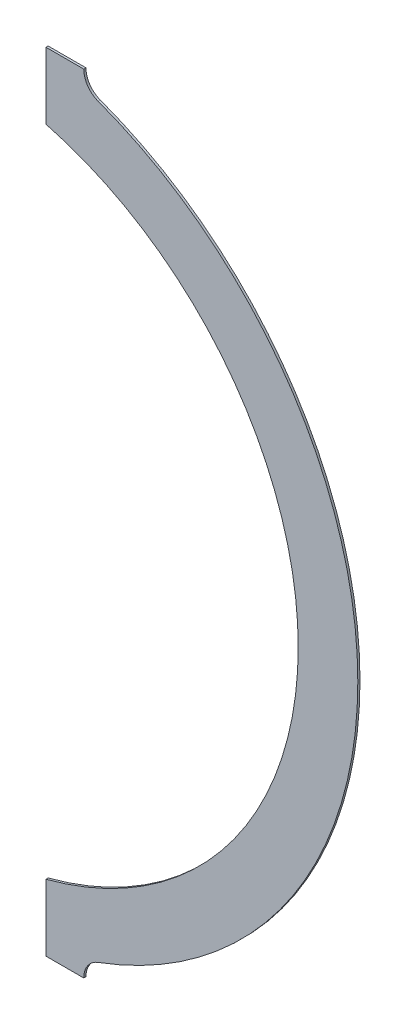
from build123d import *

# Parameters (mm, degrees)
EXTRUDE1_DEPTH = 0.205


with BuildPart() as part:
    # Sketch1 → Extrude1 (new, symmetric)
    with BuildSketch(Plane.XY):
        with BuildLine():
            Line((16.175, 74.251052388), (23.295, 74.251052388))
            ThreePointArc((23.295, 74.251052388), (24.042354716, 71.869996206), (26.01632061, 70.343095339))
            ThreePointArc((26.01632061, 70.343095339), (75, 0), (26.01632061, -70.343095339))
            ThreePointArc((26.01632061, -70.343095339), (24.042354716, -71.869996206), (23.295, -74.251052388))
            Line((23.295, -74.251052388), (16.175, -74.251052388))
            Line((16.175, -74.251052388), (16.175, -61.673024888))
            ThreePointArc((16.175, -61.673024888), (63.7588631, 0), (16.175, 61.673024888))
            Line((16.175, 61.673024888), (16.175, 74.251052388))
        make_face()
    extrude(amount=EXTRUDE1_DEPTH, both=True)


solid = part.part
